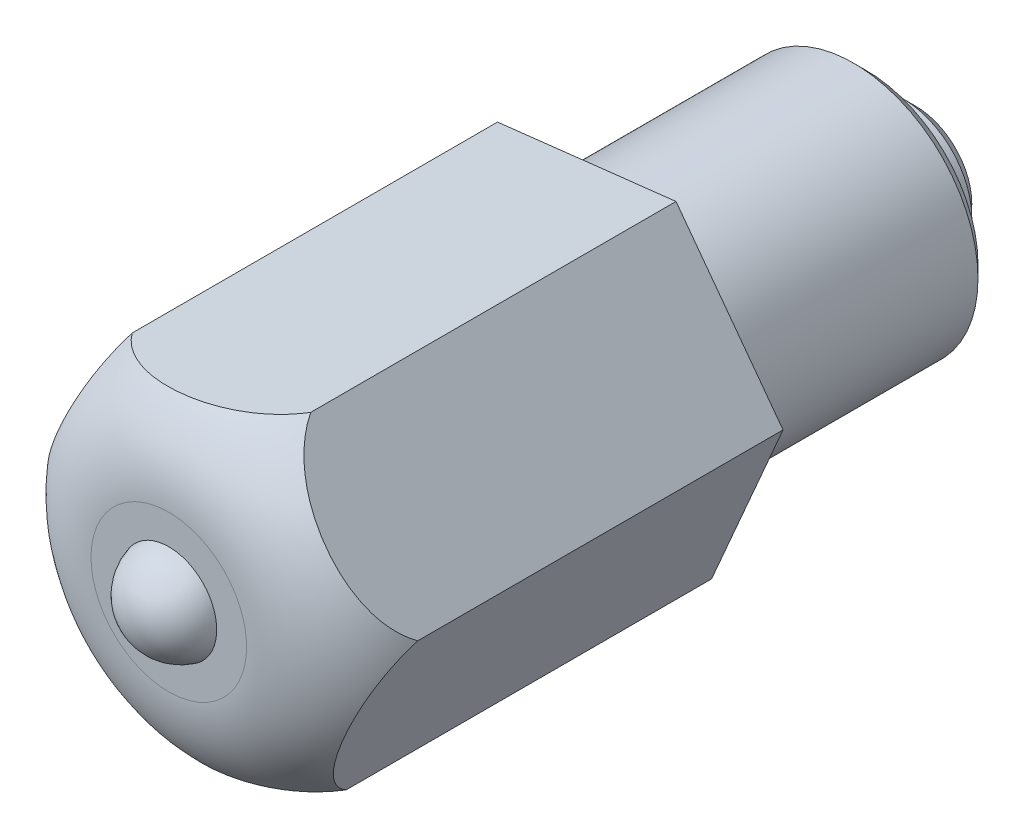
ISO-10303-21;
HEADER;
FILE_DESCRIPTION(('STEP AP214'),'2;1');
FILE_NAME('part.step','',(''),(''),'','','');
FILE_SCHEMA(('AUTOMOTIVE_DESIGN { 1 0 10303 214 1 1 1 1 }'));
ENDSEC;
DATA;
#1=APPLICATION_CONTEXT('core data for automotive mechanical design processes');
#2=APPLICATION_PROTOCOL_DEFINITION('international standard','automotive_design',2000,#1);
#3=PRODUCT_CONTEXT('',#1,'mechanical');
#4=PRODUCT('Part','Part','',(#3));
#5=PRODUCT_RELATED_PRODUCT_CATEGORY('part','',(#4));
#6=PRODUCT_DEFINITION_FORMATION('','',#4);
#7=PRODUCT_DEFINITION_CONTEXT('part definition',#1,'design');
#8=PRODUCT_DEFINITION('design','',#6,#7);
#9=PRODUCT_DEFINITION_SHAPE('','',#8);
#10=(LENGTH_UNIT() NAMED_UNIT(*) SI_UNIT(.MILLI.,.METRE.));
#11=(NAMED_UNIT(*) PLANE_ANGLE_UNIT() SI_UNIT($,.RADIAN.));
#12=(NAMED_UNIT(*) SI_UNIT($,.STERADIAN.) SOLID_ANGLE_UNIT());
#13=UNCERTAINTY_MEASURE_WITH_UNIT(LENGTH_MEASURE(1.E-05),#10,'distance_accuracy_value','');
#14=(GEOMETRIC_REPRESENTATION_CONTEXT(3) GLOBAL_UNCERTAINTY_ASSIGNED_CONTEXT((#13)) GLOBAL_UNIT_ASSIGNED_CONTEXT((#10,
#11,#12)) REPRESENTATION_CONTEXT('',''));
#15=CARTESIAN_POINT('',(0.,0.,0.));
#16=DIRECTION('',(0.,0.,1.));
#17=DIRECTION('',(1.,0.,0.));
#18=AXIS2_PLACEMENT_3D('',#15,#16,#17);
#19=CARTESIAN_POINT('',(11.499999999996,29.,142.45));
#20=DIRECTION('',(0.,0.,-1.));
#21=DIRECTION('',(-0.993473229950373,-0.114065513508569,0.));
#22=AXIS2_PLACEMENT_3D('',#19,#20,#21);
#23=DEGENERATE_TOROIDAL_SURFACE('',#22,1.25,1.75,.T.);
#24=CARTESIAN_POINT('',(8.63208981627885,28.6707212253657,143.069310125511));
#25=CARTESIAN_POINT('',(8.65255420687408,28.7178980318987,143.1373195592));
#26=CARTESIAN_POINT('',(8.67587343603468,28.7716561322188,143.199221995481));
#27=CARTESIAN_POINT('',(8.72646611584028,28.888288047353,143.310269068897));
#28=CARTESIAN_POINT('',(8.7536904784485,28.9510486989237,143.359553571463));
#29=CARTESIAN_POINT('',(8.81067347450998,29.0824122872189,143.446079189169));
#30=CARTESIAN_POINT('',(8.8404122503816,29.1509694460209,143.483405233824));
#31=CARTESIAN_POINT('',(8.90172554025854,29.292315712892,143.547547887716));
#32=CARTESIAN_POINT('',(8.9333062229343,29.3651190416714,143.574326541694));
#33=CARTESIAN_POINT('',(9.01514278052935,29.5537778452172,143.630216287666));
#34=CARTESIAN_POINT('',(9.06613328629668,29.6713268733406,143.652537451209));
#35=CARTESIAN_POINT('',(9.16895460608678,29.9083621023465,143.67643331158));
#36=CARTESIAN_POINT('',(9.22078710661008,30.0278521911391,143.677959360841));
#37=CARTESIAN_POINT('',(9.29848038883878,30.2069594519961,143.664662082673));
#38=CARTESIAN_POINT('',(9.32457071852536,30.2671058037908,143.657514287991));
#39=CARTESIAN_POINT('',(9.37641034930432,30.3866123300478,143.637637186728));
#40=CARTESIAN_POINT('',(9.40215956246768,30.4459723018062,143.624906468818));
#41=CARTESIAN_POINT('',(9.47841538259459,30.6217657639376,143.57786965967));
#42=CARTESIAN_POINT('',(9.52817121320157,30.736468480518,143.534684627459));
#43=CARTESIAN_POINT('',(9.60354404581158,30.9102263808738,143.443979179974));
#44=CARTESIAN_POINT('',(9.63083889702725,30.9731495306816,143.405144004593));
#45=CARTESIAN_POINT('',(9.68260697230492,31.0924910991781,143.317157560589));
#46=CARTESIAN_POINT('',(9.70708996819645,31.1489320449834,143.268043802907));
#47=CARTESIAN_POINT('',(9.73886077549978,31.2221736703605,143.191463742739));
#48=CARTESIAN_POINT('',(9.74779791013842,31.2427765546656,143.168238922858));
#49=CARTESIAN_POINT('',(9.76492492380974,31.2822596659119,143.120058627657));
#50=CARTESIAN_POINT('',(9.77311382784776,31.3011376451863,143.095100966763));
#51=CARTESIAN_POINT('',(9.78088112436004,31.319043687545,143.069310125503));
#52=B_SPLINE_CURVE_WITH_KNOTS('',3,(#24,#25,#26,#27,#28,#29,#30,#31,#32,#33,#34,#35,#36,#37,#38,
#39,#40,#41,#42,#43,#44,#45,#46,#47,#48,#49,#50,#51),.UNSPECIFIED.,.F.,.F.,(4,2,2,2,2,2,2,2,2,2,
2,2,2,4),(0.,0.254496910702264,0.506037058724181,0.75574897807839,1.0063514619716,
1.39452844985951,1.78361337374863,1.9812412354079,2.1789190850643,2.57247718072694,
2.80819267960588,3.04306250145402,3.1398978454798,3.23685762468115),.UNSPECIFIED.);
#53=CARTESIAN_POINT('',(8.63208981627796,28.6707212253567,143.069310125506));
#54=VERTEX_POINT('',#53);
#55=CARTESIAN_POINT('',(9.78088112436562,31.3190436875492,143.069310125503));
#56=VERTEX_POINT('',#55);
#57=EDGE_CURVE('E20',#54,#56,#52,.T.);
#58=ORIENTED_EDGE('',*,*,#57,.F.);
#59=CARTESIAN_POINT('',(10.3512086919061,26.3516775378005,143.069310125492));
#60=CARTESIAN_POINT('',(10.3205845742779,26.3929886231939,143.137319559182));
#61=CARTESIAN_POINT('',(10.2856883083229,26.4400627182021,143.199221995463));
#62=CARTESIAN_POINT('',(10.2099784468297,26.5421932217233,143.31026906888));
#63=CARTESIAN_POINT('',(10.1692383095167,26.5971505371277,143.359553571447));
#64=CARTESIAN_POINT('',(10.0839656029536,26.7121810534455,143.446079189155));
#65=CARTESIAN_POINT('',(10.0394627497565,26.7722141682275,143.48340523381));
#66=CARTESIAN_POINT('',(9.94770993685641,26.8959861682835,143.547547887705));
#67=CARTESIAN_POINT('',(9.90045074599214,26.9597375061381,143.574326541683));
#68=CARTESIAN_POINT('',(9.77798570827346,27.1249394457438,143.630216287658));
#69=CARTESIAN_POINT('',(9.70168051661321,27.2278730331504,143.652537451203));
#70=CARTESIAN_POINT('',(9.54781264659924,27.4354365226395,143.676433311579));
#71=CARTESIAN_POINT('',(9.47024744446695,27.5400698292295,143.677959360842));
#72=CARTESIAN_POINT('',(9.35398264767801,27.6969078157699,143.664662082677));
#73=CARTESIAN_POINT('',(9.31493954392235,27.7495758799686,143.657514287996));
#74=CARTESIAN_POINT('',(9.23736367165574,27.8542235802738,143.637637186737));
#75=CARTESIAN_POINT('',(9.19883103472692,27.9062030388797,143.624906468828));
#76=CARTESIAN_POINT('',(9.0847173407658,28.0601392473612,143.577869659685));
#77=CARTESIAN_POINT('',(9.01025978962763,28.1605804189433,143.534684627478));
#78=CARTESIAN_POINT('',(8.89746745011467,28.3127341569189,143.443979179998));
#79=CARTESIAN_POINT('',(8.85662182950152,28.3678337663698,143.405144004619));
#80=CARTESIAN_POINT('',(8.77915303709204,28.4723370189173,143.317157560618));
#81=CARTESIAN_POINT('',(8.74251524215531,28.5217603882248,143.268043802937));
#82=CARTESIAN_POINT('',(8.69497153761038,28.5858955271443,143.191463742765));
#83=CARTESIAN_POINT('',(8.68159748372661,28.6039367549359,143.168238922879));
#84=CARTESIAN_POINT('',(8.65596761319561,28.6385107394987,143.120058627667));
#85=CARTESIAN_POINT('',(8.64371325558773,28.6550415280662,143.095100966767));
#86=CARTESIAN_POINT('',(8.63208981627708,28.6707212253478,143.069310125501));
#87=B_SPLINE_CURVE_WITH_KNOTS('',3,(#59,#60,#61,#62,#63,#64,#65,#66,#67,#68,#69,#70,#71,#72,#73,
#74,#75,#76,#77,#78,#79,#80,#81,#82,#83,#84,#85,#86),.UNSPECIFIED.,.F.,.F.,(4,2,2,2,2,2,2,2,2,2,
2,2,2,4),(0.,0.254496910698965,0.506037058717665,0.755748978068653,1.00635146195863,
1.39452844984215,1.78361337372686,1.98124123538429,2.17891908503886,2.57247718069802,
2.80819267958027,3.04306250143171,3.13989784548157,3.23685762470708),.UNSPECIFIED.);
#88=CARTESIAN_POINT('',(10.3512086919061,26.3516775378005,143.069310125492));
#89=VERTEX_POINT('',#88);
#90=EDGE_CURVE('E100',#89,#54,#87,.T.);
#91=ORIENTED_EDGE('',*,*,#90,.F.);
#92=CARTESIAN_POINT('',(13.2191188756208,26.6809563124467,143.069310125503));
#93=CARTESIAN_POINT('',(13.168030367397,26.6750905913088,143.137319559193));
#94=CARTESIAN_POINT('',(13.1098148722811,26.6684065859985,143.199221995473));
#95=CARTESIAN_POINT('',(12.9835123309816,26.6539051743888,143.31026906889));
#96=CARTESIAN_POINT('',(12.91554783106,26.6461018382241,143.359553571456));
#97=CARTESIAN_POINT('',(12.7732921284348,26.6297687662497,143.446079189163));
#98=CARTESIAN_POINT('',(12.6990504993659,26.621244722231,143.483405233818));
#99=CARTESIAN_POINT('',(12.5459843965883,26.6036704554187,143.547547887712));
#100=CARTESIAN_POINT('',(12.467144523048,26.5946184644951,143.574326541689));
#101=CARTESIAN_POINT('',(12.2628429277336,26.5711616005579,143.630216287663));
#102=CARTESIAN_POINT('',(12.1355472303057,26.5565461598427,143.652537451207));
#103=CARTESIAN_POINT('',(11.8788580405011,26.5270744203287,143.67643331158));
#104=CARTESIAN_POINT('',(11.7494603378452,26.5122176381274,143.677959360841));
#105=CARTESIAN_POINT('',(11.5555022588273,26.4899483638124,143.664662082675));
#106=CARTESIAN_POINT('',(11.4903688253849,26.4824700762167,143.657514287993));
#107=CARTESIAN_POINT('',(11.3609533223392,26.4676112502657,143.637637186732));
#108=CARTESIAN_POINT('',(11.296671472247,26.4602307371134,143.624906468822));
#109=CARTESIAN_POINT('',(11.1063019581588,26.4383734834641,143.577869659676));
#110=CARTESIAN_POINT('',(10.9820885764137,26.4241119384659,143.534684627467));
#111=CARTESIAN_POINT('',(10.7939234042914,26.4025077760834,143.443979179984));
#112=CARTESIAN_POINT('',(10.7257829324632,26.3946842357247,143.405144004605));
#113=CARTESIAN_POINT('',(10.5965460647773,26.3798459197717,143.317157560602));
#114=CARTESIAN_POINT('',(10.5354252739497,26.3728283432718,143.268043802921));
#115=CARTESIAN_POINT('',(10.4561107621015,26.363721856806,143.191463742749));
#116=CARTESIAN_POINT('',(10.4337995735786,26.3611602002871,143.168238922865));
#117=CARTESIAN_POINT('',(10.3910426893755,26.3562510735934,143.120058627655));
#118=CARTESIAN_POINT('',(10.3705994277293,26.3539038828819,143.095100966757));
#119=CARTESIAN_POINT('',(10.3512086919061,26.3516775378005,143.069310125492));
#120=B_SPLINE_CURVE_WITH_KNOTS('',3,(#92,#93,#94,#95,#96,#97,#98,#99,#100,#101,#102,#103,#104,
#105,#106,#107,#108,#109,#110,#111,#112,#113,#114,#115,#116,#117,#118,#119),.UNSPECIFIED.,.F.,
.F.,(4,2,2,2,2,2,2,2,2,2,2,2,2,4),(0.,0.254496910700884,0.506037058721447,0.755748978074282,
1.00635146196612,1.39452844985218,1.78361337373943,1.98124123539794,2.17891908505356,
2.57247718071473,2.80819267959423,3.04306250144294,3.13989784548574,3.23685762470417),.UNSPECIFIED.);
#121=CARTESIAN_POINT('',(13.2191188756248,26.6809563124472,143.069310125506));
#122=VERTEX_POINT('',#121);
#123=EDGE_CURVE('E91',#122,#89,#120,.T.);
#124=ORIENTED_EDGE('',*,*,#123,.F.);
#125=CARTESIAN_POINT('',(14.3679101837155,29.3292787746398,143.069310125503));
#126=CARTESIAN_POINT('',(14.3474457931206,29.2821019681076,143.137319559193));
#127=CARTESIAN_POINT('',(14.3241265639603,29.2283438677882,143.199221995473));
#128=CARTESIAN_POINT('',(14.2735338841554,29.1117119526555,143.31026906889));
#129=CARTESIAN_POINT('',(14.2463095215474,29.0489513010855,143.359553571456));
#130=CARTESIAN_POINT('',(14.1893265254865,28.9175877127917,143.446079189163));
#131=CARTESIAN_POINT('',(14.1595877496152,28.8490305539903,143.483405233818));
#132=CARTESIAN_POINT('',(14.0982744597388,28.7076842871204,143.547547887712));
#133=CARTESIAN_POINT('',(14.0666937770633,28.6348809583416,143.574326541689));
#134=CARTESIAN_POINT('',(13.9848572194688,28.4462221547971,143.630216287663));
#135=CARTESIAN_POINT('',(13.9338667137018,28.3286731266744,143.652537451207));
#136=CARTESIAN_POINT('',(13.8310453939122,28.0916378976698,143.67643331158));
#137=CARTESIAN_POINT('',(13.7792128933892,27.9721478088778,143.677959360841));
#138=CARTESIAN_POINT('',(13.7015196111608,27.7930405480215,143.664662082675));
#139=CARTESIAN_POINT('',(13.6754292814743,27.7328941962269,143.657514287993));
#140=CARTESIAN_POINT('',(13.6235896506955,27.6133876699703,143.637637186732));
#141=CARTESIAN_POINT('',(13.5978404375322,27.554027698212,143.624906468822));
#142=CARTESIAN_POINT('',(13.5215846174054,27.3782342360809,143.577869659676));
#143=CARTESIAN_POINT('',(13.4718287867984,27.2635315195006,143.534684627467));
#144=CARTESIAN_POINT('',(13.3964559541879,27.0897736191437,143.443979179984));
#145=CARTESIAN_POINT('',(13.3691611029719,27.026850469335,143.405144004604));
#146=CARTESIAN_POINT('',(13.3173930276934,26.9075089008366,143.317157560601));
#147=CARTESIAN_POINT('',(13.2929100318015,26.8510679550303,143.26804380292));
#148=CARTESIAN_POINT('',(13.2611392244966,26.7778263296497,143.19146374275));
#149=CARTESIAN_POINT('',(13.252202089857,26.7572234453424,143.168238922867));
#150=CARTESIAN_POINT('',(13.2350750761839,26.7177403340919,143.120058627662));
#151=CARTESIAN_POINT('',(13.226886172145,26.6988623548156,143.095100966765));
#152=CARTESIAN_POINT('',(13.219118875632,26.680956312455,143.069310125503));
#153=B_SPLINE_CURVE_WITH_KNOTS('',3,(#125,#126,#127,#128,#129,#130,#131,#132,#133,#134,#135,
#136,#137,#138,#139,#140,#141,#142,#143,#144,#145,#146,#147,#148,#149,#150,#151,#152),
.UNSPECIFIED.,.F.,.F.,(4,2,2,2,2,2,2,2,2,2,2,2,2,4),(0.,0.254496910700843,0.506037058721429,
0.755748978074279,1.00635146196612,1.39452844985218,1.78361337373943,1.98124123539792,
2.17891908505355,2.57247718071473,2.80819267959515,3.04306250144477,3.13989784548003,
3.23685762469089),.UNSPECIFIED.);
#154=CARTESIAN_POINT('',(14.3679101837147,29.3292787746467,143.069310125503));
#155=VERTEX_POINT('',#154);
#156=EDGE_CURVE('E96',#155,#122,#153,.T.);
#157=ORIENTED_EDGE('',*,*,#156,.F.);
#158=CARTESIAN_POINT('',(12.6487913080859,31.6483224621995,143.069310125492));
#159=CARTESIAN_POINT('',(12.6794154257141,31.6070113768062,143.137319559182));
#160=CARTESIAN_POINT('',(12.7143116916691,31.559937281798,143.199221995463));
#161=CARTESIAN_POINT('',(12.7900215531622,31.4578067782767,143.31026906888));
#162=CARTESIAN_POINT('',(12.8307616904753,31.4028494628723,143.359553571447));
#163=CARTESIAN_POINT('',(12.9160343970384,31.2878189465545,143.446079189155));
#164=CARTESIAN_POINT('',(12.9605372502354,31.2277858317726,143.48340523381));
#165=CARTESIAN_POINT('',(13.0522900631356,31.1040138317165,143.547547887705));
#166=CARTESIAN_POINT('',(13.0995492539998,31.0402624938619,143.574326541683));
#167=CARTESIAN_POINT('',(13.2220142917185,30.8750605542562,143.630216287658));
#168=CARTESIAN_POINT('',(13.2983194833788,30.7721269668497,143.652537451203));
#169=CARTESIAN_POINT('',(13.4521873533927,30.5645634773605,143.676433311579));
#170=CARTESIAN_POINT('',(13.529752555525,30.4599301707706,143.677959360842));
#171=CARTESIAN_POINT('',(13.646017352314,30.3030921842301,143.664662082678));
#172=CARTESIAN_POINT('',(13.6850604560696,30.2504241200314,143.657514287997));
#173=CARTESIAN_POINT('',(13.7626363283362,30.1457764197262,143.637637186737));
#174=CARTESIAN_POINT('',(13.8011689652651,30.0937969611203,143.624906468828));
#175=CARTESIAN_POINT('',(13.9152826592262,29.9398607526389,143.577869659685));
#176=CARTESIAN_POINT('',(13.9897402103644,29.8394195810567,143.534684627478));
#177=CARTESIAN_POINT('',(14.1025325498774,29.6872658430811,143.443979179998));
#178=CARTESIAN_POINT('',(14.1433781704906,29.6321662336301,143.405144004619));
#179=CARTESIAN_POINT('',(14.2208469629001,29.5276629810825,143.317157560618));
#180=CARTESIAN_POINT('',(14.2574847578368,29.478239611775,143.268043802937));
#181=CARTESIAN_POINT('',(14.3050284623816,29.4141044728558,143.191463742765));
#182=CARTESIAN_POINT('',(14.3184025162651,29.3960632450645,143.16823892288));
#183=CARTESIAN_POINT('',(14.3440323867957,29.3614892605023,143.120058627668));
#184=CARTESIAN_POINT('',(14.3562867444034,29.344958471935,143.095100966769));
#185=CARTESIAN_POINT('',(14.3679101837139,29.3292787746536,143.069310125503));
#186=B_SPLINE_CURVE_WITH_KNOTS('',3,(#158,#159,#160,#161,#162,#163,#164,#165,#166,#167,#168,
#169,#170,#171,#172,#173,#174,#175,#176,#177,#178,#179,#180,#181,#182,#183,#184,#185),
.UNSPECIFIED.,.F.,.F.,(4,2,2,2,2,2,2,2,2,2,2,2,2,4),(0.,0.254496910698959,0.506037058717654,
0.755748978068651,1.00635146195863,1.39452844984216,1.78361337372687,1.98124123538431,
2.17891908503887,2.57247718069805,2.80819267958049,3.04306250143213,3.13989784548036,
3.23685762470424),.UNSPECIFIED.);
#187=CARTESIAN_POINT('',(12.6487913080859,31.6483224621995,143.069310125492));
#188=VERTEX_POINT('',#187);
#189=EDGE_CURVE('E40',#188,#155,#186,.T.);
#190=ORIENTED_EDGE('',*,*,#189,.F.);
#191=CARTESIAN_POINT('',(9.78088112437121,31.3190436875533,143.069310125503));
#192=CARTESIAN_POINT('',(9.83196963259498,31.3249094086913,143.137319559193));
#193=CARTESIAN_POINT('',(9.89018512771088,31.3315934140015,143.199221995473));
#194=CARTESIAN_POINT('',(10.0164876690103,31.3460948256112,143.31026906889));
#195=CARTESIAN_POINT('',(10.0844521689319,31.3538981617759,143.359553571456));
#196=CARTESIAN_POINT('',(10.2267078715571,31.3702312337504,143.446079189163));
#197=CARTESIAN_POINT('',(10.3009495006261,31.378755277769,143.483405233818));
#198=CARTESIAN_POINT('',(10.4540156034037,31.3963295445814,143.547547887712));
#199=CARTESIAN_POINT('',(10.532855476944,31.405381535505,143.574326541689));
#200=CARTESIAN_POINT('',(10.7371570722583,31.4288383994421,143.630216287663));
#201=CARTESIAN_POINT('',(10.8644527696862,31.4434538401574,143.652537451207));
#202=CARTESIAN_POINT('',(11.1211419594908,31.4729255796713,143.67643331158));
#203=CARTESIAN_POINT('',(11.2505396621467,31.4877823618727,143.677959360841));
#204=CARTESIAN_POINT('',(11.4444977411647,31.5100516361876,143.664662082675));
#205=CARTESIAN_POINT('',(11.509631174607,31.5175299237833,143.657514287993));
#206=CARTESIAN_POINT('',(11.6390466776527,31.5323887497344,143.637637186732));
#207=CARTESIAN_POINT('',(11.7033285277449,31.5397692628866,143.624906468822));
#208=CARTESIAN_POINT('',(11.8936980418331,31.5616265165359,143.577869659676));
#209=CARTESIAN_POINT('',(12.0179114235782,31.5758880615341,143.534684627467));
#210=CARTESIAN_POINT('',(12.2060765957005,31.5974922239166,143.443979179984));
#211=CARTESIAN_POINT('',(12.2742170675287,31.6053157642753,143.405144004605));
#212=CARTESIAN_POINT('',(12.4034539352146,31.6201540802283,143.317157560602));
#213=CARTESIAN_POINT('',(12.4645747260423,31.6271716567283,143.268043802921));
#214=CARTESIAN_POINT('',(12.5438892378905,31.636278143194,143.19146374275));
#215=CARTESIAN_POINT('',(12.5662004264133,31.6388397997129,143.168238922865));
#216=CARTESIAN_POINT('',(12.6089573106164,31.6437489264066,143.120058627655));
#217=CARTESIAN_POINT('',(12.6294005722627,31.6460961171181,143.095100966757));
#218=CARTESIAN_POINT('',(12.6487913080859,31.6483224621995,143.069310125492));
#219=B_SPLINE_CURVE_WITH_KNOTS('',3,(#191,#192,#193,#194,#195,#196,#197,#198,#199,#200,#201,
#202,#203,#204,#205,#206,#207,#208,#209,#210,#211,#212,#213,#214,#215,#216,#217,#218),
.UNSPECIFIED.,.F.,.F.,(4,2,2,2,2,2,2,2,2,2,2,2,2,4),(0.,0.254496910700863,0.506037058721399,
0.755748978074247,1.00635146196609,1.39452844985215,1.78361337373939,1.98124123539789,
2.17891908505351,2.57247718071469,2.80819267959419,3.04306250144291,3.13989784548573,
3.23685762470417),.UNSPECIFIED.);
#220=EDGE_CURVE('E141',#56,#188,#219,.T.);
#221=ORIENTED_EDGE('',*,*,#220,.F.);
#222=EDGE_LOOP('',(#58,#91,#124,#157,#190,#221));
#223=FACE_BOUND('',#222,.T.);
#224=CARTESIAN_POINT('',(11.499999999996,29.,144.2));
#225=DIRECTION('',(0.,0.,-1.));
#226=DIRECTION('',(-0.993473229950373,-0.114065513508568,0.));
#227=AXIS2_PLACEMENT_3D('',#224,#225,#226);
#228=CIRCLE('',#227,1.25);
#229=CARTESIAN_POINT('',(10.258158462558,28.8574181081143,144.2));
#230=VERTEX_POINT('',#229);
#231=EDGE_CURVE('E11',#230,#230,#228,.T.);
#232=ORIENTED_EDGE('',*,*,#231,.T.);
#233=EDGE_LOOP('',(#232));
#234=FACE_BOUND('',#233,.T.);
#235=ADVANCED_FACE('F16',(#223,#234),#23,.T.);
#236=CARTESIAN_POINT('',(11.499999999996,29.,144.006));
#237=DIRECTION('',(0.993473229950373,0.11406551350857,0.));
#238=DIRECTION('',(-0.11406551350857,0.993473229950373,0.));
#239=AXIS2_PLACEMENT_3D('',#236,#237,#238);
#240=SPHERICAL_SURFACE('',#239,0.794);
#241=CARTESIAN_POINT('',(11.499999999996,29.,144.006));
#242=DIRECTION('',(0.,0.,-1.));
#243=DIRECTION('',(-0.993473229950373,-0.114065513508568,0.));
#244=AXIS2_PLACEMENT_3D('',#241,#242,#243);
#245=SPHERICAL_SURFACE('',#244,0.794);
#246=CARTESIAN_POINT('',(11.499999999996,29.,144.2));
#247=DIRECTION('',(0.,0.,-1.));
#248=DIRECTION('',(-0.993473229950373,-0.114065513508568,0.));
#249=AXIS2_PLACEMENT_3D('',#246,#247,#248);
#250=CIRCLE('',#249,0.769935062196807);
#251=CARTESIAN_POINT('',(10.7350901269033,28.9121769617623,144.2));
#252=VERTEX_POINT('',#251);
#253=EDGE_CURVE('E168',#252,#252,#250,.T.);
#254=ORIENTED_EDGE('',*,*,#253,.F.);
#255=EDGE_LOOP('',(#254));
#256=FACE_BOUND('',#255,.T.);
#257=ADVANCED_FACE('F128',(#256),#245,.T.);
#258=CARTESIAN_POINT('',(11.4999999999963,29.,132.2));
#259=DIRECTION('',(0.,0.,1.));
#260=DIRECTION('',(0.993473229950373,0.11406551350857,0.));
#261=AXIS2_PLACEMENT_3D('',#258,#259,#260);
#262=CONICAL_SURFACE('',#261,0.899999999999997,0.785398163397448);
#263=CARTESIAN_POINT('',(11.4999999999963,29.,132.4));
#264=DIRECTION('',(0.,0.,1.));
#265=DIRECTION('',(0.993473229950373,0.114065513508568,0.));
#266=AXIS2_PLACEMENT_3D('',#263,#264,#265);
#267=CIRCLE('',#266,1.1);
#268=CARTESIAN_POINT('',(12.5928205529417,29.1254720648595,132.4));
#269=VERTEX_POINT('',#268);
#270=EDGE_CURVE('E186',#269,#269,#267,.T.);
#271=ORIENTED_EDGE('',*,*,#270,.F.);
#272=EDGE_LOOP('',(#271));
#273=FACE_BOUND('',#272,.T.);
#274=CARTESIAN_POINT('',(11.4999999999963,29.,132.2));
#275=DIRECTION('',(0.,0.,-1.));
#276=DIRECTION('',(0.993473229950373,0.114065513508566,0.));
#277=AXIS2_PLACEMENT_3D('',#274,#275,#276);
#278=CIRCLE('',#277,0.899999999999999);
#279=CARTESIAN_POINT('',(12.3941259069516,29.1026589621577,132.2));
#280=VERTEX_POINT('',#279);
#281=EDGE_CURVE('E177',#280,#280,#278,.T.);
#282=ORIENTED_EDGE('',*,*,#281,.F.);
#283=EDGE_LOOP('',(#282));
#284=FACE_BOUND('',#283,.T.);
#285=ADVANCED_FACE('F205',(#273,#284),#262,.T.);
#286=CARTESIAN_POINT('',(11.4999999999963,29.,133.));
#287=DIRECTION('',(0.,0.,1.));
#288=DIRECTION('',(0.993473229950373,0.11406551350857,0.));
#289=AXIS2_PLACEMENT_3D('',#286,#287,#288);
#290=CONICAL_SURFACE('',#289,1.8,0.785398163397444);
#291=CARTESIAN_POINT('',(11.4999999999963,29.,133.2));
#292=DIRECTION('',(0.,0.,1.));
#293=DIRECTION('',(0.993473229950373,0.114065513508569,0.));
#294=AXIS2_PLACEMENT_3D('',#291,#292,#293);
#295=CIRCLE('',#294,2.);
#296=CARTESIAN_POINT('',(13.486946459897,29.2281310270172,133.2));
#297=VERTEX_POINT('',#296);
#298=EDGE_CURVE('E190',#297,#297,#295,.T.);
#299=ORIENTED_EDGE('',*,*,#298,.F.);
#300=EDGE_LOOP('',(#299));
#301=FACE_BOUND('',#300,.T.);
#302=CARTESIAN_POINT('',(11.4999999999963,29.,133.));
#303=DIRECTION('',(0.,0.,-1.));
#304=DIRECTION('',(0.993473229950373,0.114065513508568,0.));
#305=AXIS2_PLACEMENT_3D('',#302,#303,#304);
#306=CIRCLE('',#305,1.8);
#307=CARTESIAN_POINT('',(13.288251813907,29.2053179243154,133.));
#308=VERTEX_POINT('',#307);
#309=EDGE_CURVE('E195',#308,#308,#306,.T.);
#310=ORIENTED_EDGE('',*,*,#309,.F.);
#311=EDGE_LOOP('',(#310));
#312=FACE_BOUND('',#311,.T.);
#313=ADVANCED_FACE('F207',(#301,#312),#290,.T.);
#314=CARTESIAN_POINT('',(11.4999999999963,29.,132.2));
#315=DIRECTION('',(0.,0.,-1.));
#316=DIRECTION('',(-0.993473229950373,-0.114065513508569,0.));
#317=AXIS2_PLACEMENT_3D('',#314,#315,#316);
#318=CYLINDRICAL_SURFACE('',#317,2.);
#319=ORIENTED_EDGE('',*,*,#298,.T.);
#320=EDGE_LOOP('',(#319));
#321=FACE_BOUND('',#320,.T.);
#322=CARTESIAN_POINT('',(11.4999999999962,29.,137.2));
#323=DIRECTION('',(0.,0.,-1.));
#324=DIRECTION('',(-0.993473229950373,-0.114065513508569,0.));
#325=AXIS2_PLACEMENT_3D('',#322,#323,#324);
#326=CIRCLE('',#325,2.);
#327=CARTESIAN_POINT('',(9.51305354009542,28.7718689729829,137.2));
#328=VERTEX_POINT('',#327);
#329=EDGE_CURVE('E31',#328,#328,#326,.T.);
#330=ORIENTED_EDGE('',*,*,#329,.T.);
#331=EDGE_LOOP('',(#330));
#332=FACE_BOUND('',#331,.T.);
#333=ADVANCED_FACE('F213',(#321,#332),#318,.T.);
#334=CARTESIAN_POINT('',(11.4999999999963,29.,132.2));
#335=DIRECTION('',(0.,0.,-1.));
#336=DIRECTION('',(-0.993473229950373,-0.114065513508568,0.));
#337=AXIS2_PLACEMENT_3D('',#334,#335,#336);
#338=CYLINDRICAL_SURFACE('',#337,1.1);
#339=ORIENTED_EDGE('',*,*,#270,.T.);
#340=EDGE_LOOP('',(#339));
#341=FACE_BOUND('',#340,.T.);
#342=CARTESIAN_POINT('',(11.4999999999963,29.,133.));
#343=DIRECTION('',(0.,0.,-1.));
#344=DIRECTION('',(-0.993473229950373,-0.114065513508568,0.));
#345=AXIS2_PLACEMENT_3D('',#342,#343,#344);
#346=CIRCLE('',#345,1.1);
#347=CARTESIAN_POINT('',(10.4071794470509,28.8745279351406,133.));
#348=VERTEX_POINT('',#347);
#349=EDGE_CURVE('E187',#348,#348,#346,.T.);
#350=ORIENTED_EDGE('',*,*,#349,.T.);
#351=EDGE_LOOP('',(#350));
#352=FACE_BOUND('',#351,.T.);
#353=ADVANCED_FACE('F221',(#341,#352),#338,.T.);
#354=CARTESIAN_POINT('',(11.271868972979,30.9869464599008,137.2));
#355=DIRECTION('',(0.,0.,1.));
#356=DIRECTION('',(0.993473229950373,0.114065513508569,0.));
#357=AXIS2_PLACEMENT_3D('',#354,#355,#356);
#358=PLANE('',#357);
#359=ORIENTED_EDGE('',*,*,#329,.F.);
#360=EDGE_LOOP('',(#359));
#361=FACE_BOUND('',#360,.T.);
#362=DIRECTION('',(-0.595520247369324,0.803340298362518,0.));
#363=VECTOR('',#362,1.);
#364=CARTESIAN_POINT('',(10.3512086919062,26.3516775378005,137.2));
#365=LINE('',#364,#363);
#366=CARTESIAN_POINT('',(10.3512086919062,26.3516775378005,137.2));
#367=VERTEX_POINT('',#366);
#368=CARTESIAN_POINT('',(8.63208981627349,28.6707212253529,137.2));
#369=VERTEX_POINT('',#368);
#370=EDGE_CURVE('E184',#367,#369,#365,.T.);
#371=ORIENTED_EDGE('',*,*,#370,.T.);
#372=DIRECTION('',(0.397952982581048,0.917405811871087,0.));
#373=VECTOR('',#372,1.);
#374=CARTESIAN_POINT('',(8.63208981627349,28.6707212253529,137.2));
#375=LINE('',#374,#373);
#376=CARTESIAN_POINT('',(9.7808811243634,31.3190436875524,137.2));
#377=VERTEX_POINT('',#376);
#378=EDGE_CURVE('E62',#369,#377,#375,.T.);
#379=ORIENTED_EDGE('',*,*,#378,.T.);
#380=DIRECTION('',(0.993473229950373,0.114065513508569,0.));
#381=VECTOR('',#380,1.);
#382=CARTESIAN_POINT('',(9.7808811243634,31.3190436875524,137.2));
#383=LINE('',#382,#381);
#384=CARTESIAN_POINT('',(12.6487913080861,31.6483224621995,137.2));
#385=VERTEX_POINT('',#384);
#386=EDGE_CURVE('E167',#377,#385,#383,.T.);
#387=ORIENTED_EDGE('',*,*,#386,.T.);
#388=DIRECTION('',(0.595520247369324,-0.803340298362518,0.));
#389=VECTOR('',#388,1.);
#390=CARTESIAN_POINT('',(12.6487913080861,31.6483224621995,137.2));
#391=LINE('',#390,#389);
#392=CARTESIAN_POINT('',(14.3679101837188,29.3292787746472,137.2));
#393=VERTEX_POINT('',#392);
#394=EDGE_CURVE('E179',#385,#393,#391,.T.);
#395=ORIENTED_EDGE('',*,*,#394,.T.);
#396=DIRECTION('',(-0.397952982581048,-0.917405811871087,0.));
#397=VECTOR('',#396,1.);
#398=CARTESIAN_POINT('',(14.3679101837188,29.3292787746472,137.2));
#399=LINE('',#398,#397);
#400=CARTESIAN_POINT('',(13.2191188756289,26.6809563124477,137.2));
#401=VERTEX_POINT('',#400);
#402=EDGE_CURVE('E176',#393,#401,#399,.T.);
#403=ORIENTED_EDGE('',*,*,#402,.T.);
#404=DIRECTION('',(-0.993473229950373,-0.114065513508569,0.));
#405=VECTOR('',#404,1.);
#406=CARTESIAN_POINT('',(13.2191188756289,26.6809563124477,137.2));
#407=LINE('',#406,#405);
#408=EDGE_CURVE('E92',#401,#367,#407,.T.);
#409=ORIENTED_EDGE('',*,*,#408,.T.);
#410=EDGE_LOOP('',(#371,#379,#387,#395,#403,#409));
#411=FACE_BOUND('',#410,.T.);
#412=ADVANCED_FACE('F225',(#361,#411),#358,.F.);
#413=CARTESIAN_POINT('',(11.4999999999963,29.,132.2));
#414=DIRECTION('',(0.,0.,1.));
#415=DIRECTION('',(0.993473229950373,0.114065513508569,0.));
#416=AXIS2_PLACEMENT_3D('',#413,#414,#415);
#417=PLANE('',#416);
#418=ORIENTED_EDGE('',*,*,#281,.T.);
#419=EDGE_LOOP('',(#418));
#420=FACE_BOUND('',#419,.T.);
#421=ADVANCED_FACE('F203',(#420),#417,.F.);
#422=CARTESIAN_POINT('',(11.3745279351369,30.0928205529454,133.));
#423=DIRECTION('',(0.,0.,1.));
#424=DIRECTION('',(0.993473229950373,0.114065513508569,0.));
#425=AXIS2_PLACEMENT_3D('',#422,#423,#424);
#426=PLANE('',#425);
#427=ORIENTED_EDGE('',*,*,#309,.T.);
#428=EDGE_LOOP('',(#427));
#429=FACE_BOUND('',#428,.T.);
#430=ORIENTED_EDGE('',*,*,#349,.F.);
#431=EDGE_LOOP('',(#430));
#432=FACE_BOUND('',#431,.T.);
#433=ADVANCED_FACE('F232',(#429,#432),#426,.F.);
#434=CARTESIAN_POINT('',(10.351208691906,26.3516775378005,147.2));
#435=DIRECTION('',(-0.803340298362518,-0.595520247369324,0.));
#436=DIRECTION('',(0.595520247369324,-0.803340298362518,0.));
#437=AXIS2_PLACEMENT_3D('',#434,#435,#436);
#438=PLANE('',#437);
#439=ORIENTED_EDGE('',*,*,#90,.T.);
#440=DIRECTION('',(0.,0.,-1.));
#441=VECTOR('',#440,1.);
#442=CARTESIAN_POINT('',(8.63208981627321,28.6707212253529,147.2));
#443=LINE('',#442,#441);
#444=EDGE_CURVE('E101',#54,#369,#443,.T.);
#445=ORIENTED_EDGE('',*,*,#444,.T.);
#446=ORIENTED_EDGE('',*,*,#370,.F.);
#447=DIRECTION('',(0.,0.,-1.));
#448=VECTOR('',#447,1.);
#449=CARTESIAN_POINT('',(10.351208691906,26.3516775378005,147.2));
#450=LINE('',#449,#448);
#451=EDGE_CURVE('E82',#89,#367,#450,.T.);
#452=ORIENTED_EDGE('',*,*,#451,.F.);
#453=EDGE_LOOP('',(#439,#445,#446,#452));
#454=FACE_BOUND('',#453,.T.);
#455=ADVANCED_FACE('F234',(#454),#438,.T.);
#456=CARTESIAN_POINT('',(13.2191188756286,26.6809563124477,147.2));
#457=DIRECTION('',(0.114065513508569,-0.993473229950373,0.));
#458=DIRECTION('',(0.993473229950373,0.114065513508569,0.));
#459=AXIS2_PLACEMENT_3D('',#456,#457,#458);
#460=PLANE('',#459);
#461=ORIENTED_EDGE('',*,*,#123,.T.);
#462=ORIENTED_EDGE('',*,*,#451,.T.);
#463=ORIENTED_EDGE('',*,*,#408,.F.);
#464=DIRECTION('',(0.,0.,-1.));
#465=VECTOR('',#464,1.);
#466=CARTESIAN_POINT('',(13.2191188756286,26.6809563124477,147.2));
#467=LINE('',#466,#465);
#468=EDGE_CURVE('E88',#122,#401,#467,.T.);
#469=ORIENTED_EDGE('',*,*,#468,.F.);
#470=EDGE_LOOP('',(#461,#462,#463,#469));
#471=FACE_BOUND('',#470,.T.);
#472=ADVANCED_FACE('F90',(#471),#460,.T.);
#473=CARTESIAN_POINT('',(14.3679101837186,29.3292787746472,147.2));
#474=DIRECTION('',(0.917405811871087,-0.397952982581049,0.));
#475=DIRECTION('',(0.397952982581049,0.917405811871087,0.));
#476=AXIS2_PLACEMENT_3D('',#473,#474,#475);
#477=PLANE('',#476);
#478=ORIENTED_EDGE('',*,*,#156,.T.);
#479=ORIENTED_EDGE('',*,*,#468,.T.);
#480=ORIENTED_EDGE('',*,*,#402,.F.);
#481=DIRECTION('',(0.,0.,-1.));
#482=VECTOR('',#481,1.);
#483=CARTESIAN_POINT('',(14.3679101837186,29.3292787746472,147.2));
#484=LINE('',#483,#482);
#485=EDGE_CURVE('E104',#155,#393,#484,.T.);
#486=ORIENTED_EDGE('',*,*,#485,.F.);
#487=EDGE_LOOP('',(#478,#479,#480,#486));
#488=FACE_BOUND('',#487,.T.);
#489=ADVANCED_FACE('F103',(#488),#477,.T.);
#490=CARTESIAN_POINT('',(12.6487913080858,31.6483224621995,147.2));
#491=DIRECTION('',(0.803340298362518,0.595520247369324,0.));
#492=DIRECTION('',(-0.595520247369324,0.803340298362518,0.));
#493=AXIS2_PLACEMENT_3D('',#490,#491,#492);
#494=PLANE('',#493);
#495=ORIENTED_EDGE('',*,*,#189,.T.);
#496=ORIENTED_EDGE('',*,*,#485,.T.);
#497=ORIENTED_EDGE('',*,*,#394,.F.);
#498=DIRECTION('',(0.,0.,-1.));
#499=VECTOR('',#498,1.);
#500=CARTESIAN_POINT('',(12.6487913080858,31.6483224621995,147.2));
#501=LINE('',#500,#499);
#502=EDGE_CURVE('E147',#188,#385,#501,.T.);
#503=ORIENTED_EDGE('',*,*,#502,.F.);
#504=EDGE_LOOP('',(#495,#496,#497,#503));
#505=FACE_BOUND('',#504,.T.);
#506=ADVANCED_FACE('F152',(#505),#494,.T.);
#507=CARTESIAN_POINT('',(9.78088112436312,31.3190436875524,147.2));
#508=DIRECTION('',(-0.114065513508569,0.993473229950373,0.));
#509=DIRECTION('',(-0.993473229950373,-0.114065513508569,0.));
#510=AXIS2_PLACEMENT_3D('',#507,#508,#509);
#511=PLANE('',#510);
#512=ORIENTED_EDGE('',*,*,#220,.T.);
#513=ORIENTED_EDGE('',*,*,#502,.T.);
#514=ORIENTED_EDGE('',*,*,#386,.F.);
#515=DIRECTION('',(0.,0.,-1.));
#516=VECTOR('',#515,1.);
#517=CARTESIAN_POINT('',(9.78088112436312,31.3190436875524,147.2));
#518=LINE('',#517,#516);
#519=EDGE_CURVE('E163',#56,#377,#518,.T.);
#520=ORIENTED_EDGE('',*,*,#519,.F.);
#521=EDGE_LOOP('',(#512,#513,#514,#520));
#522=FACE_BOUND('',#521,.T.);
#523=ADVANCED_FACE('F148',(#522),#511,.T.);
#524=CARTESIAN_POINT('',(8.63208981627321,28.6707212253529,147.2));
#525=DIRECTION('',(-0.917405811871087,0.397952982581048,0.));
#526=DIRECTION('',(-0.397952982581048,-0.917405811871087,0.));
#527=AXIS2_PLACEMENT_3D('',#524,#525,#526);
#528=PLANE('',#527);
#529=ORIENTED_EDGE('',*,*,#57,.T.);
#530=ORIENTED_EDGE('',*,*,#519,.T.);
#531=ORIENTED_EDGE('',*,*,#378,.F.);
#532=ORIENTED_EDGE('',*,*,#444,.F.);
#533=EDGE_LOOP('',(#529,#530,#531,#532));
#534=FACE_BOUND('',#533,.T.);
#535=ADVANCED_FACE('F151',(#534),#528,.T.);
#536=CARTESIAN_POINT('',(11.3574181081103,30.241841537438,144.2));
#537=DIRECTION('',(0.,0.,-1.));
#538=DIRECTION('',(-0.993473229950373,-0.114065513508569,0.));
#539=AXIS2_PLACEMENT_3D('',#536,#537,#538);
#540=PLANE('',#539);
#541=ORIENTED_EDGE('',*,*,#231,.F.);
#542=EDGE_LOOP('',(#541));
#543=FACE_BOUND('',#542,.T.);
#544=ORIENTED_EDGE('',*,*,#253,.T.);
#545=EDGE_LOOP('',(#544));
#546=FACE_BOUND('',#545,.T.);
#547=ADVANCED_FACE('F18',(#543,#546),#540,.F.);
#548=CLOSED_SHELL('',(#235,#257,#285,#313,#333,#353,#412,#421,#433,#455,#472,#489,#506,#523,
#535,#547));
#549=MANIFOLD_SOLID_BREP('B1',#548);
#550=ADVANCED_BREP_SHAPE_REPRESENTATION('',(#18,#549),#14);
#551=SHAPE_DEFINITION_REPRESENTATION(#9,#550);
ENDSEC;
END-ISO-10303-21;
